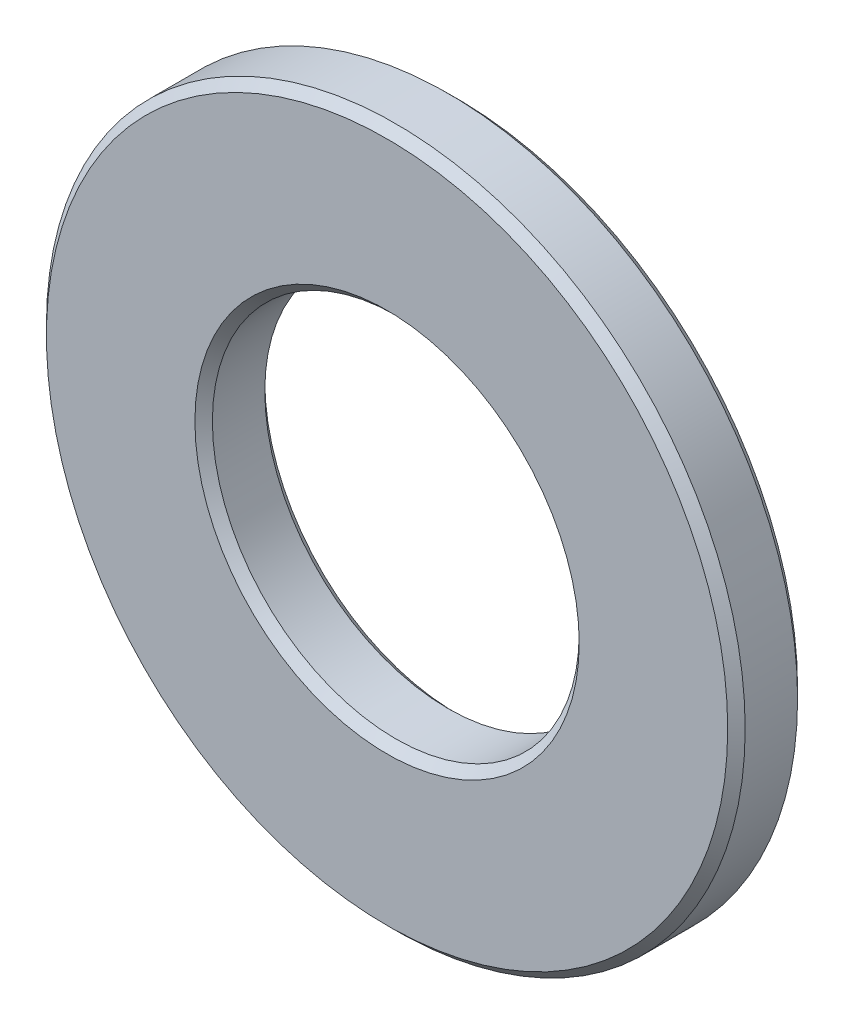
from build123d import *

# Parameters (mm, degrees)
SKETCH2_R           = 8
SKETCH2_R_2         = 4.2
BOSS_EXTRUDE1_DEPTH = 0.8
CHAMFER1_SIZE       = 0.2
CHAMFER2_SIZE       = 0.2
CHAMFER3_SIZE       = 0.2
CHAMFER4_SIZE       = 0.2


with BuildPart() as part:
    # Sketch2 → Boss-Extrude1 (new, symmetric)
    with BuildSketch(Plane.XY):
        Circle(SKETCH2_R)
        Circle(SKETCH2_R_2, mode=Mode.SUBTRACT)
    extrude(amount=BOSS_EXTRUDE1_DEPTH, both=True)

    # Chamfer1
    chamfer1_edges = [part.edges().sort_by_distance(p)[0] for p in [
        (-8, 0, 0.8),
    ]]
    chamfer(chamfer1_edges, length=CHAMFER1_SIZE)

    # Chamfer2
    chamfer2_edges = [part.edges().sort_by_distance(p)[0] for p in [
        (-8, 0, -0.8),
    ]]
    chamfer(chamfer2_edges, length=CHAMFER2_SIZE)

    # Chamfer3
    chamfer3_edges = [part.edges().sort_by_distance(p)[0] for p in [
        (-4.2, 0, -0.8),
    ]]
    chamfer(chamfer3_edges, length=CHAMFER3_SIZE)

    # Chamfer4
    chamfer4_edges = [part.edges().sort_by_distance(p)[0] for p in [
        (-4.2, 0, 0.8),
    ]]
    chamfer(chamfer4_edges, length=CHAMFER4_SIZE)


solid = part.part
